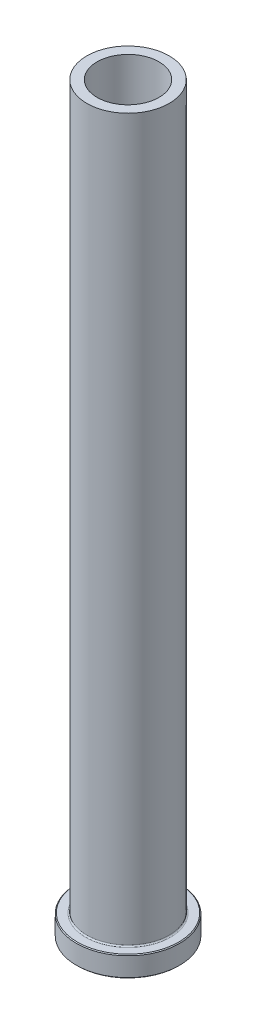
ISO-10303-21;
HEADER;
FILE_DESCRIPTION(('STEP AP214'),'2;1');
FILE_NAME('part.step','',(''),(''),'','','');
FILE_SCHEMA(('AUTOMOTIVE_DESIGN { 1 0 10303 214 1 1 1 1 }'));
ENDSEC;
DATA;
#1=APPLICATION_CONTEXT('core data for automotive mechanical design processes');
#2=APPLICATION_PROTOCOL_DEFINITION('international standard','automotive_design',2000,#1);
#3=PRODUCT_CONTEXT('',#1,'mechanical');
#4=PRODUCT('Part','Part','',(#3));
#5=PRODUCT_RELATED_PRODUCT_CATEGORY('part','',(#4));
#6=PRODUCT_DEFINITION_FORMATION('','',#4);
#7=PRODUCT_DEFINITION_CONTEXT('part definition',#1,'design');
#8=PRODUCT_DEFINITION('design','',#6,#7);
#9=PRODUCT_DEFINITION_SHAPE('','',#8);
#10=(LENGTH_UNIT() NAMED_UNIT(*) SI_UNIT(.MILLI.,.METRE.));
#11=(NAMED_UNIT(*) PLANE_ANGLE_UNIT() SI_UNIT($,.RADIAN.));
#12=(NAMED_UNIT(*) SI_UNIT($,.STERADIAN.) SOLID_ANGLE_UNIT());
#13=UNCERTAINTY_MEASURE_WITH_UNIT(LENGTH_MEASURE(1.E-05),#10,'distance_accuracy_value','');
#14=(GEOMETRIC_REPRESENTATION_CONTEXT(3) GLOBAL_UNCERTAINTY_ASSIGNED_CONTEXT((#13)) GLOBAL_UNIT_ASSIGNED_CONTEXT((#10,
#11,#12)) REPRESENTATION_CONTEXT('',''));
#15=CARTESIAN_POINT('',(0.,0.,0.));
#16=DIRECTION('',(0.,0.,1.));
#17=DIRECTION('',(1.,0.,0.));
#18=AXIS2_PLACEMENT_3D('',#15,#16,#17);
#19=CARTESIAN_POINT('',(0.,0.,0.));
#20=DIRECTION('',(0.,-1.,0.));
#21=DIRECTION('',(0.,0.,-1.));
#22=AXIS2_PLACEMENT_3D('',#19,#20,#21);
#23=PLANE('',#22);
#24=CARTESIAN_POINT('',(0.,0.,0.));
#25=DIRECTION('',(0.,-1.,0.));
#26=DIRECTION('',(0.,0.,-1.));
#27=AXIS2_PLACEMENT_3D('',#24,#25,#26);
#28=CIRCLE('',#27,15.621);
#29=CARTESIAN_POINT('',(0.,0.,-15.621));
#30=VERTEX_POINT('',#29);
#31=EDGE_CURVE('E44',#30,#30,#28,.T.);
#32=ORIENTED_EDGE('',*,*,#31,.T.);
#33=EDGE_LOOP('',(#32));
#34=FACE_BOUND('',#33,.T.);
#35=CARTESIAN_POINT('',(0.,0.,0.));
#36=DIRECTION('',(0.,-1.,0.));
#37=DIRECTION('',(0.,0.,-1.));
#38=AXIS2_PLACEMENT_3D('',#35,#36,#37);
#39=CIRCLE('',#38,10.112375);
#40=CARTESIAN_POINT('',(0.,0.,-10.112375));
#41=VERTEX_POINT('',#40);
#42=EDGE_CURVE('E58',#41,#41,#39,.T.);
#43=ORIENTED_EDGE('',*,*,#42,.F.);
#44=EDGE_LOOP('',(#43));
#45=FACE_BOUND('',#44,.T.);
#46=ADVANCED_FACE('F29',(#34,#45),#23,.T.);
#47=CARTESIAN_POINT('',(0.,0.,0.));
#48=DIRECTION('',(0.,-1.,0.));
#49=DIRECTION('',(0.,0.,-1.));
#50=AXIS2_PLACEMENT_3D('',#47,#48,#49);
#51=CYLINDRICAL_SURFACE('',#50,15.875);
#52=CARTESIAN_POINT('',(0.,0.253999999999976,0.));
#53=DIRECTION('',(0.,-1.,0.));
#54=DIRECTION('',(0.,0.,-1.));
#55=AXIS2_PLACEMENT_3D('',#52,#53,#54);
#56=CIRCLE('',#55,15.875);
#57=CARTESIAN_POINT('',(0.,0.253999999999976,-15.875));
#58=VERTEX_POINT('',#57);
#59=EDGE_CURVE('E36',#58,#58,#56,.F.);
#60=ORIENTED_EDGE('',*,*,#59,.T.);
#61=EDGE_LOOP('',(#60));
#62=FACE_BOUND('',#61,.T.);
#63=CARTESIAN_POINT('',(0.,6.09599999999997,0.));
#64=DIRECTION('',(0.,1.,0.));
#65=DIRECTION('',(0.,0.,1.));
#66=AXIS2_PLACEMENT_3D('',#63,#64,#65);
#67=CIRCLE('',#66,15.875);
#68=CARTESIAN_POINT('',(0.,6.09599999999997,15.875));
#69=VERTEX_POINT('',#68);
#70=EDGE_CURVE('E40',#69,#69,#67,.F.);
#71=ORIENTED_EDGE('',*,*,#70,.T.);
#72=EDGE_LOOP('',(#71));
#73=FACE_BOUND('',#72,.T.);
#74=ADVANCED_FACE('F103',(#62,#73),#51,.T.);
#75=CARTESIAN_POINT('',(15.875,6.35,0.));
#76=DIRECTION('',(0.,1.,0.));
#77=DIRECTION('',(0.,0.,1.));
#78=AXIS2_PLACEMENT_3D('',#75,#76,#77);
#79=PLANE('',#78);
#80=CARTESIAN_POINT('',(0.,6.35,0.));
#81=DIRECTION('',(0.,1.,0.));
#82=DIRECTION('',(0.,0.,1.));
#83=AXIS2_PLACEMENT_3D('',#80,#81,#82);
#84=CIRCLE('',#83,15.621);
#85=CARTESIAN_POINT('',(0.,6.35,15.621));
#86=VERTEX_POINT('',#85);
#87=EDGE_CURVE('E10',#86,#86,#84,.T.);
#88=ORIENTED_EDGE('',*,*,#87,.T.);
#89=EDGE_LOOP('',(#88));
#90=FACE_BOUND('',#89,.T.);
#91=CARTESIAN_POINT('',(0.,6.35,0.));
#92=DIRECTION('',(0.,-1.,0.));
#93=DIRECTION('',(0.,0.,-1.));
#94=AXIS2_PLACEMENT_3D('',#91,#92,#93);
#95=CIRCLE('',#94,13.090525);
#96=CARTESIAN_POINT('',(0.,6.35,-13.090525));
#97=VERTEX_POINT('',#96);
#98=EDGE_CURVE('E49',#97,#97,#95,.T.);
#99=ORIENTED_EDGE('',*,*,#98,.T.);
#100=EDGE_LOOP('',(#99));
#101=FACE_BOUND('',#100,.T.);
#102=ADVANCED_FACE('F109',(#90,#101),#79,.T.);
#103=CARTESIAN_POINT('',(0.,6.746875,0.));
#104=DIRECTION('',(0.,-1.,0.));
#105=DIRECTION('',(0.,0.,-1.));
#106=AXIS2_PLACEMENT_3D('',#103,#104,#105);
#107=TOROIDAL_SURFACE('',#106,13.090525,0.396875);
#108=CARTESIAN_POINT('',(0.,6.746875,0.));
#109=DIRECTION('',(0.,-1.,0.));
#110=DIRECTION('',(0.,0.,-1.));
#111=AXIS2_PLACEMENT_3D('',#108,#109,#110);
#112=CIRCLE('',#111,12.69365);
#113=CARTESIAN_POINT('',(0.,6.746875,-12.69365));
#114=VERTEX_POINT('',#113);
#115=EDGE_CURVE('E52',#114,#114,#112,.T.);
#116=ORIENTED_EDGE('',*,*,#115,.T.);
#117=EDGE_LOOP('',(#116));
#118=FACE_BOUND('',#117,.T.);
#119=ORIENTED_EDGE('',*,*,#98,.F.);
#120=EDGE_LOOP('',(#119));
#121=FACE_BOUND('',#120,.T.);
#122=ADVANCED_FACE('F139',(#118,#121),#107,.F.);
#123=CARTESIAN_POINT('',(0.,0.,0.));
#124=DIRECTION('',(0.,-1.,0.));
#125=DIRECTION('',(0.,0.,-1.));
#126=AXIS2_PLACEMENT_3D('',#123,#124,#125);
#127=CYLINDRICAL_SURFACE('',#126,12.69365);
#128=CARTESIAN_POINT('',(0.,228.6,0.));
#129=DIRECTION('',(0.,-1.,0.));
#130=DIRECTION('',(0.,0.,-1.));
#131=AXIS2_PLACEMENT_3D('',#128,#129,#130);
#132=CIRCLE('',#131,12.69365);
#133=CARTESIAN_POINT('',(0.,228.6,-12.69365));
#134=VERTEX_POINT('',#133);
#135=EDGE_CURVE('E55',#134,#134,#132,.T.);
#136=ORIENTED_EDGE('',*,*,#135,.T.);
#137=EDGE_LOOP('',(#136));
#138=FACE_BOUND('',#137,.T.);
#139=ORIENTED_EDGE('',*,*,#115,.F.);
#140=EDGE_LOOP('',(#139));
#141=FACE_BOUND('',#140,.T.);
#142=ADVANCED_FACE('F182',(#138,#141),#127,.T.);
#143=CARTESIAN_POINT('',(12.69365,228.6,0.));
#144=DIRECTION('',(0.,1.,0.));
#145=DIRECTION('',(0.,0.,1.));
#146=AXIS2_PLACEMENT_3D('',#143,#144,#145);
#147=PLANE('',#146);
#148=CARTESIAN_POINT('',(0.,228.6,0.));
#149=DIRECTION('',(0.,-1.,0.));
#150=DIRECTION('',(0.,0.,-1.));
#151=AXIS2_PLACEMENT_3D('',#148,#149,#150);
#152=CIRCLE('',#151,9.525);
#153=CARTESIAN_POINT('',(0.,228.6,-9.525));
#154=VERTEX_POINT('',#153);
#155=EDGE_CURVE('E70',#154,#154,#152,.T.);
#156=ORIENTED_EDGE('',*,*,#155,.T.);
#157=EDGE_LOOP('',(#156));
#158=FACE_BOUND('',#157,.T.);
#159=ORIENTED_EDGE('',*,*,#135,.F.);
#160=EDGE_LOOP('',(#159));
#161=FACE_BOUND('',#160,.T.);
#162=ADVANCED_FACE('F74',(#158,#161),#147,.T.);
#163=CARTESIAN_POINT('',(0.,0.,0.));
#164=DIRECTION('',(0.,-1.,0.));
#165=DIRECTION('',(0.,0.,-1.));
#166=AXIS2_PLACEMENT_3D('',#163,#164,#165);
#167=CONICAL_SURFACE('',#166,10.112375,0.785398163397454);
#168=CARTESIAN_POINT('',(0.,0.396875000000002,0.));
#169=DIRECTION('',(0.,-1.,0.));
#170=DIRECTION('',(0.,0.,-1.));
#171=AXIS2_PLACEMENT_3D('',#168,#169,#170);
#172=CIRCLE('',#171,9.7155);
#173=CARTESIAN_POINT('',(0.,0.396875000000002,-9.7155));
#174=VERTEX_POINT('',#173);
#175=EDGE_CURVE('E61',#174,#174,#172,.T.);
#176=ORIENTED_EDGE('',*,*,#175,.F.);
#177=EDGE_LOOP('',(#176));
#178=FACE_BOUND('',#177,.T.);
#179=ORIENTED_EDGE('',*,*,#42,.T.);
#180=EDGE_LOOP('',(#179));
#181=FACE_BOUND('',#180,.T.);
#182=ADVANCED_FACE('F93',(#178,#181),#167,.F.);
#183=CARTESIAN_POINT('',(0.,0.,0.));
#184=DIRECTION('',(0.,-1.,0.));
#185=DIRECTION('',(0.,0.,-1.));
#186=AXIS2_PLACEMENT_3D('',#183,#184,#185);
#187=CYLINDRICAL_SURFACE('',#186,9.7155);
#188=CARTESIAN_POINT('',(0.,154.1145,0.));
#189=DIRECTION('',(0.,-1.,0.));
#190=DIRECTION('',(0.,0.,-1.));
#191=AXIS2_PLACEMENT_3D('',#188,#189,#190);
#192=CIRCLE('',#191,9.7155);
#193=CARTESIAN_POINT('',(0.,154.1145,-9.7155));
#194=VERTEX_POINT('',#193);
#195=EDGE_CURVE('E64',#194,#194,#192,.T.);
#196=ORIENTED_EDGE('',*,*,#195,.F.);
#197=EDGE_LOOP('',(#196));
#198=FACE_BOUND('',#197,.T.);
#199=ORIENTED_EDGE('',*,*,#175,.T.);
#200=EDGE_LOOP('',(#199));
#201=FACE_BOUND('',#200,.T.);
#202=ADVANCED_FACE('F87',(#198,#201),#187,.F.);
#203=CARTESIAN_POINT('',(0.,154.1145,0.));
#204=DIRECTION('',(0.,-1.,0.));
#205=DIRECTION('',(0.,0.,-1.));
#206=AXIS2_PLACEMENT_3D('',#203,#204,#205);
#207=CONICAL_SURFACE('',#206,9.7155,0.0133325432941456);
#208=CARTESIAN_POINT('',(0.,168.402,0.));
#209=DIRECTION('',(0.,-1.,0.));
#210=DIRECTION('',(0.,0.,-1.));
#211=AXIS2_PLACEMENT_3D('',#208,#209,#210);
#212=CIRCLE('',#211,9.525);
#213=CARTESIAN_POINT('',(0.,168.402,-9.525));
#214=VERTEX_POINT('',#213);
#215=EDGE_CURVE('E67',#214,#214,#212,.T.);
#216=ORIENTED_EDGE('',*,*,#215,.F.);
#217=EDGE_LOOP('',(#216));
#218=FACE_BOUND('',#217,.T.);
#219=ORIENTED_EDGE('',*,*,#195,.T.);
#220=EDGE_LOOP('',(#219));
#221=FACE_BOUND('',#220,.T.);
#222=ADVANCED_FACE('F81',(#218,#221),#207,.F.);
#223=CARTESIAN_POINT('',(0.,0.,0.));
#224=DIRECTION('',(0.,-1.,0.));
#225=DIRECTION('',(0.,0.,-1.));
#226=AXIS2_PLACEMENT_3D('',#223,#224,#225);
#227=CYLINDRICAL_SURFACE('',#226,9.525);
#228=ORIENTED_EDGE('',*,*,#155,.F.);
#229=EDGE_LOOP('',(#228));
#230=FACE_BOUND('',#229,.T.);
#231=ORIENTED_EDGE('',*,*,#215,.T.);
#232=EDGE_LOOP('',(#231));
#233=FACE_BOUND('',#232,.T.);
#234=ADVANCED_FACE('F77',(#230,#233),#227,.F.);
#235=CARTESIAN_POINT('',(0.,0.,0.));
#236=DIRECTION('',(0.,1.,0.));
#237=DIRECTION('',(0.,0.,1.));
#238=AXIS2_PLACEMENT_3D('',#235,#236,#237);
#239=CONICAL_SURFACE('',#238,15.621,0.785398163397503);
#240=ORIENTED_EDGE('',*,*,#59,.F.);
#241=EDGE_LOOP('',(#240));
#242=FACE_BOUND('',#241,.T.);
#243=ORIENTED_EDGE('',*,*,#31,.F.);
#244=EDGE_LOOP('',(#243));
#245=FACE_BOUND('',#244,.T.);
#246=ADVANCED_FACE('F80',(#242,#245),#239,.T.);
#247=CARTESIAN_POINT('',(0.,6.09599999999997,0.));
#248=DIRECTION('',(0.,-1.,0.));
#249=DIRECTION('',(0.,0.,-1.));
#250=AXIS2_PLACEMENT_3D('',#247,#248,#249);
#251=CONICAL_SURFACE('',#250,15.875,0.785398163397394);
#252=ORIENTED_EDGE('',*,*,#87,.F.);
#253=EDGE_LOOP('',(#252));
#254=FACE_BOUND('',#253,.T.);
#255=ORIENTED_EDGE('',*,*,#70,.F.);
#256=EDGE_LOOP('',(#255));
#257=FACE_BOUND('',#256,.T.);
#258=ADVANCED_FACE('F31',(#254,#257),#251,.T.);
#259=CLOSED_SHELL('',(#46,#74,#102,#122,#142,#162,#182,#202,#222,#234,#246,#258));
#260=MANIFOLD_SOLID_BREP('B2',#259);
#261=ADVANCED_BREP_SHAPE_REPRESENTATION('',(#18,#260),#14);
#262=SHAPE_DEFINITION_REPRESENTATION(#9,#261);
ENDSEC;
END-ISO-10303-21;
